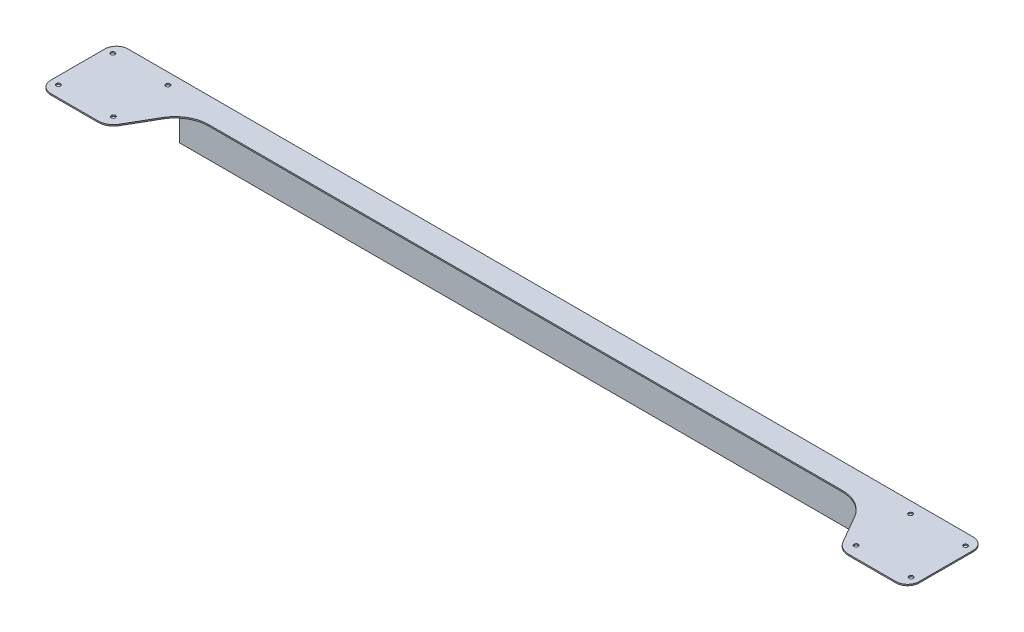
ISO-10303-21;
HEADER;
FILE_DESCRIPTION(('STEP AP214'),'2;1');
FILE_NAME('part.step','',(''),(''),'','','');
FILE_SCHEMA(('AUTOMOTIVE_DESIGN { 1 0 10303 214 1 1 1 1 }'));
ENDSEC;
DATA;
#1=APPLICATION_CONTEXT('core data for automotive mechanical design processes');
#2=APPLICATION_PROTOCOL_DEFINITION('international standard','automotive_design',2000,#1);
#3=PRODUCT_CONTEXT('',#1,'mechanical');
#4=PRODUCT('Part','Part','',(#3));
#5=PRODUCT_RELATED_PRODUCT_CATEGORY('part','',(#4));
#6=PRODUCT_DEFINITION_FORMATION('','',#4);
#7=PRODUCT_DEFINITION_CONTEXT('part definition',#1,'design');
#8=PRODUCT_DEFINITION('design','',#6,#7);
#9=PRODUCT_DEFINITION_SHAPE('','',#8);
#10=(LENGTH_UNIT() NAMED_UNIT(*) SI_UNIT(.MILLI.,.METRE.));
#11=(NAMED_UNIT(*) PLANE_ANGLE_UNIT() SI_UNIT($,.RADIAN.));
#12=(NAMED_UNIT(*) SI_UNIT($,.STERADIAN.) SOLID_ANGLE_UNIT());
#13=UNCERTAINTY_MEASURE_WITH_UNIT(LENGTH_MEASURE(1.E-05),#10,'distance_accuracy_value','');
#14=(GEOMETRIC_REPRESENTATION_CONTEXT(3) GLOBAL_UNCERTAINTY_ASSIGNED_CONTEXT((#13)) GLOBAL_UNIT_ASSIGNED_CONTEXT((#10,
#11,#12)) REPRESENTATION_CONTEXT('',''));
#15=CARTESIAN_POINT('',(0.,0.,0.));
#16=DIRECTION('',(0.,0.,1.));
#17=DIRECTION('',(1.,0.,0.));
#18=AXIS2_PLACEMENT_3D('',#15,#16,#17);
#19=CARTESIAN_POINT('',(4141.94054132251,12.7,4174.57954132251));
#20=DIRECTION('',(0.,1.,0.));
#21=DIRECTION('',(0.,0.,1.));
#22=AXIS2_PLACEMENT_3D('',#19,#20,#21);
#23=PLANE('',#22);
#24=CARTESIAN_POINT('',(4180.04054132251,12.7,4177.11954132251));
#25=DIRECTION('',(0.,1.,0.));
#26=DIRECTION('',(0.,0.,1.));
#27=AXIS2_PLACEMENT_3D('',#24,#25,#26);
#28=CIRCLE('',#27,20.6375000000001);
#29=CARTESIAN_POINT('',(4180.04054132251,12.7,4197.75704132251));
#30=VERTEX_POINT('',#29);
#31=EDGE_CURVE('E349',#30,#30,#28,.T.);
#32=ORIENTED_EDGE('',*,*,#31,.F.);
#33=EDGE_LOOP('',(#32));
#34=FACE_BOUND('',#33,.T.);
#35=CARTESIAN_POINT('',(3640.19612534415,12.7,3643.11712534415));
#36=DIRECTION('',(0.,1.,0.));
#37=DIRECTION('',(0.,0.,1.));
#38=AXIS2_PLACEMENT_3D('',#35,#36,#37);
#39=CIRCLE('',#38,20.6375000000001);
#40=CARTESIAN_POINT('',(3640.19612534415,12.7,3663.75462534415));
#41=VERTEX_POINT('',#40);
#42=EDGE_CURVE('E337',#41,#41,#39,.T.);
#43=ORIENTED_EDGE('',*,*,#42,.F.);
#44=EDGE_LOOP('',(#43));
#45=FACE_BOUND('',#44,.T.);
#46=CARTESIAN_POINT('',(-3640.19612534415,12.7,3643.11712534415));
#47=DIRECTION('',(0.,1.,0.));
#48=DIRECTION('',(0.,0.,1.));
#49=AXIS2_PLACEMENT_3D('',#46,#47,#48);
#50=CIRCLE('',#49,20.6375000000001);
#51=CARTESIAN_POINT('',(-3640.19612534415,12.7,3663.75462534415));
#52=VERTEX_POINT('',#51);
#53=EDGE_CURVE('E325',#52,#52,#50,.T.);
#54=ORIENTED_EDGE('',*,*,#53,.F.);
#55=EDGE_LOOP('',(#54));
#56=FACE_BOUND('',#55,.T.);
#57=CARTESIAN_POINT('',(-4180.04054132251,12.7,3643.11712534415));
#58=DIRECTION('',(0.,1.,0.));
#59=DIRECTION('',(0.,0.,1.));
#60=AXIS2_PLACEMENT_3D('',#57,#58,#59);
#61=CIRCLE('',#60,20.6375000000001);
#62=CARTESIAN_POINT('',(-4180.04054132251,12.7,3663.75462534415));
#63=VERTEX_POINT('',#62);
#64=EDGE_CURVE('E196',#63,#63,#61,.T.);
#65=ORIENTED_EDGE('',*,*,#64,.F.);
#66=EDGE_LOOP('',(#65));
#67=FACE_BOUND('',#66,.T.);
#68=CARTESIAN_POINT('',(4141.94054132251,12.7,4174.57954132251));
#69=DIRECTION('',(0.,1.,0.));
#70=DIRECTION('',(0.,0.,1.));
#71=AXIS2_PLACEMENT_3D('',#68,#69,#70);
#72=CIRCLE('',#71,114.3);
#73=CARTESIAN_POINT('',(4141.94054132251,12.7,4288.87954132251));
#74=VERTEX_POINT('',#73);
#75=CARTESIAN_POINT('',(4256.24054132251,12.7,4174.57954132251));
#76=VERTEX_POINT('',#75);
#77=EDGE_CURVE('E224',#74,#76,#72,.T.);
#78=ORIENTED_EDGE('',*,*,#77,.T.);
#79=DIRECTION('',(0.,0.,-1.));
#80=VECTOR('',#79,1.);
#81=CARTESIAN_POINT('',(4256.24054132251,12.7,3645.65712534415));
#82=LINE('',#81,#80);
#83=CARTESIAN_POINT('',(4256.24054132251,12.7,3645.65712534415));
#84=VERTEX_POINT('',#83);
#85=EDGE_CURVE('E124',#76,#84,#82,.T.);
#86=ORIENTED_EDGE('',*,*,#85,.T.);
#87=CARTESIAN_POINT('',(4141.94054132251,12.7,3645.65712534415));
#88=DIRECTION('',(0.,1.,0.));
#89=DIRECTION('',(0.,0.,-1.));
#90=AXIS2_PLACEMENT_3D('',#87,#88,#89);
#91=CIRCLE('',#90,114.3);
#92=CARTESIAN_POINT('',(4141.94054132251,12.7,3531.35712534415));
#93=VERTEX_POINT('',#92);
#94=EDGE_CURVE('E263',#84,#93,#91,.T.);
#95=ORIENTED_EDGE('',*,*,#94,.T.);
#96=DIRECTION('',(-1.,0.,0.));
#97=VECTOR('',#96,1.);
#98=CARTESIAN_POINT('',(-4141.94054132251,12.7,3531.35712534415));
#99=LINE('',#98,#97);
#100=CARTESIAN_POINT('',(-4141.94054132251,12.7,3531.35712534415));
#101=VERTEX_POINT('',#100);
#102=EDGE_CURVE('E282',#93,#101,#99,.T.);
#103=ORIENTED_EDGE('',*,*,#102,.T.);
#104=CARTESIAN_POINT('',(-4141.94054132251,12.7,3645.65712534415));
#105=DIRECTION('',(0.,1.,0.));
#106=DIRECTION('',(0.,0.,1.));
#107=AXIS2_PLACEMENT_3D('',#104,#105,#106);
#108=CIRCLE('',#107,114.3);
#109=CARTESIAN_POINT('',(-4256.24054132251,12.7,3645.65712534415));
#110=VERTEX_POINT('',#109);
#111=EDGE_CURVE('E279',#101,#110,#108,.T.);
#112=ORIENTED_EDGE('',*,*,#111,.T.);
#113=DIRECTION('',(0.,0.,1.));
#114=VECTOR('',#113,1.);
#115=CARTESIAN_POINT('',(-4256.24054132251,12.7,3645.65712534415));
#116=LINE('',#115,#114);
#117=CARTESIAN_POINT('',(-4256.24054132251,12.7,4174.57954132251));
#118=VERTEX_POINT('',#117);
#119=EDGE_CURVE('E281',#110,#118,#116,.T.);
#120=ORIENTED_EDGE('',*,*,#119,.T.);
#121=CARTESIAN_POINT('',(-4141.94054132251,12.7,4174.57954132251));
#122=DIRECTION('',(0.,1.,0.));
#123=DIRECTION('',(0.,0.,1.));
#124=AXIS2_PLACEMENT_3D('',#121,#122,#123);
#125=CIRCLE('',#124,114.300000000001);
#126=CARTESIAN_POINT('',(-4141.94054132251,12.7,4288.87954132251));
#127=VERTEX_POINT('',#126);
#128=EDGE_CURVE('E284',#118,#127,#125,.T.);
#129=ORIENTED_EDGE('',*,*,#128,.T.);
#130=DIRECTION('',(1.,0.,0.));
#131=VECTOR('',#130,1.);
#132=CARTESIAN_POINT('',(-4141.94054132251,12.7,4288.87954132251));
#133=LINE('',#132,#131);
#134=CARTESIAN_POINT('',(-3678.29610755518,12.7,4288.87954132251));
#135=VERTEX_POINT('',#134);
#136=EDGE_CURVE('E290',#127,#135,#133,.T.);
#137=ORIENTED_EDGE('',*,*,#136,.T.);
#138=CARTESIAN_POINT('',(-3678.29610755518,12.7,4136.47954132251));
#139=DIRECTION('',(0.,1.,0.));
#140=DIRECTION('',(0.,0.,1.));
#141=AXIS2_PLACEMENT_3D('',#138,#139,#140);
#142=CIRCLE('',#141,152.399999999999);
#143=CARTESIAN_POINT('',(-3546.31383601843,12.7,4212.67954132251));
#144=VERTEX_POINT('',#143);
#145=EDGE_CURVE('E292',#135,#144,#142,.T.);
#146=ORIENTED_EDGE('',*,*,#145,.T.);
#147=DIRECTION('',(0.5,0.,-0.866025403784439));
#148=VECTOR('',#147,1.);
#149=CARTESIAN_POINT('',(-3546.31383601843,12.7,4212.67954132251));
#150=LINE('',#149,#148);
#151=CARTESIAN_POINT('',(-3390.55352459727,12.7,3942.89476813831));
#152=VERTEX_POINT('',#151);
#153=EDGE_CURVE('E294',#144,#152,#150,.T.);
#154=ORIENTED_EDGE('',*,*,#153,.T.);
#155=CARTESIAN_POINT('',(-3104.59193626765,12.7,4107.99476813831));
#156=DIRECTION('',(0.,-1.,0.));
#157=DIRECTION('',(0.,0.,-1.));
#158=AXIS2_PLACEMENT_3D('',#155,#156,#157);
#159=CIRCLE('',#158,330.200000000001);
#160=CARTESIAN_POINT('',(-3104.59193626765,12.7,3777.79476813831));
#161=VERTEX_POINT('',#160);
#162=EDGE_CURVE('E296',#152,#161,#159,.T.);
#163=ORIENTED_EDGE('',*,*,#162,.T.);
#164=DIRECTION('',(1.,0.,0.));
#165=VECTOR('',#164,1.);
#166=CARTESIAN_POINT('',(-3104.59193626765,12.7,3777.79476813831));
#167=LINE('',#166,#165);
#168=CARTESIAN_POINT('',(3104.59195443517,12.7,3777.79476813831));
#169=VERTEX_POINT('',#168);
#170=EDGE_CURVE('E298',#161,#169,#167,.T.);
#171=ORIENTED_EDGE('',*,*,#170,.T.);
#172=CARTESIAN_POINT('',(3104.59195443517,12.7,4107.99476813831));
#173=DIRECTION('',(0.,-1.,0.));
#174=DIRECTION('',(0.,0.,-1.));
#175=AXIS2_PLACEMENT_3D('',#172,#173,#174);
#176=CIRCLE('',#175,330.200000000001);
#177=CARTESIAN_POINT('',(3390.55354276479,12.7,3942.89476813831));
#178=VERTEX_POINT('',#177);
#179=EDGE_CURVE('E171',#169,#178,#176,.T.);
#180=ORIENTED_EDGE('',*,*,#179,.T.);
#181=DIRECTION('',(0.500000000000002,0.,0.866025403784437));
#182=VECTOR('',#181,1.);
#183=CARTESIAN_POINT('',(3390.55354276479,12.7,3942.89476813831));
#184=LINE('',#183,#182);
#185=CARTESIAN_POINT('',(3546.31385418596,12.7,4212.67954132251));
#186=VERTEX_POINT('',#185);
#187=EDGE_CURVE('E164',#178,#186,#184,.T.);
#188=ORIENTED_EDGE('',*,*,#187,.T.);
#189=CARTESIAN_POINT('',(3678.29612572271,12.7,4136.47954132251));
#190=DIRECTION('',(0.,1.,0.));
#191=DIRECTION('',(0.,0.,-1.));
#192=AXIS2_PLACEMENT_3D('',#189,#190,#191);
#193=CIRCLE('',#192,152.399999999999);
#194=CARTESIAN_POINT('',(3678.29612572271,12.7,4288.87954132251));
#195=VERTEX_POINT('',#194);
#196=EDGE_CURVE('E168',#186,#195,#193,.T.);
#197=ORIENTED_EDGE('',*,*,#196,.T.);
#198=DIRECTION('',(1.,0.,0.));
#199=VECTOR('',#198,1.);
#200=CARTESIAN_POINT('',(3678.29612572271,12.7,4288.87954132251));
#201=LINE('',#200,#199);
#202=EDGE_CURVE('E59',#195,#74,#201,.T.);
#203=ORIENTED_EDGE('',*,*,#202,.T.);
#204=EDGE_LOOP('',(#78,#86,#95,#103,#112,#120,#129,#137,#146,#154,#163,#171,#180,#188,#197,#203));
#205=FACE_BOUND('',#204,.T.);
#206=CARTESIAN_POINT('',(-4180.04054132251,12.7,4177.11954132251));
#207=DIRECTION('',(0.,1.,0.));
#208=DIRECTION('',(0.,0.,1.));
#209=AXIS2_PLACEMENT_3D('',#206,#207,#208);
#210=CIRCLE('',#209,20.6375000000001);
#211=CARTESIAN_POINT('',(-4180.04054132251,12.7,4197.75704132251));
#212=VERTEX_POINT('',#211);
#213=EDGE_CURVE('E319',#212,#212,#210,.T.);
#214=ORIENTED_EDGE('',*,*,#213,.F.);
#215=EDGE_LOOP('',(#214));
#216=FACE_BOUND('',#215,.T.);
#217=CARTESIAN_POINT('',(-3640.19612534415,12.7,4177.11954132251));
#218=DIRECTION('',(0.,1.,0.));
#219=DIRECTION('',(0.,0.,1.));
#220=AXIS2_PLACEMENT_3D('',#217,#218,#219);
#221=CIRCLE('',#220,20.6375000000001);
#222=CARTESIAN_POINT('',(-3640.19612534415,12.7,4197.75704132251));
#223=VERTEX_POINT('',#222);
#224=EDGE_CURVE('E331',#223,#223,#221,.T.);
#225=ORIENTED_EDGE('',*,*,#224,.F.);
#226=EDGE_LOOP('',(#225));
#227=FACE_BOUND('',#226,.T.);
#228=CARTESIAN_POINT('',(4180.04054132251,12.7,3643.11712534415));
#229=DIRECTION('',(0.,1.,0.));
#230=DIRECTION('',(0.,0.,1.));
#231=AXIS2_PLACEMENT_3D('',#228,#229,#230);
#232=CIRCLE('',#231,20.6375000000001);
#233=CARTESIAN_POINT('',(4180.04054132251,12.7,3663.75462534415));
#234=VERTEX_POINT('',#233);
#235=EDGE_CURVE('E343',#234,#234,#232,.T.);
#236=ORIENTED_EDGE('',*,*,#235,.F.);
#237=EDGE_LOOP('',(#236));
#238=FACE_BOUND('',#237,.T.);
#239=CARTESIAN_POINT('',(3640.19612534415,12.7,4177.11954132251));
#240=DIRECTION('',(0.,1.,0.));
#241=DIRECTION('',(0.,0.,1.));
#242=AXIS2_PLACEMENT_3D('',#239,#240,#241);
#243=CIRCLE('',#242,20.6375000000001);
#244=CARTESIAN_POINT('',(3640.19612534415,12.7,4197.75704132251));
#245=VERTEX_POINT('',#244);
#246=EDGE_CURVE('E355',#245,#245,#243,.T.);
#247=ORIENTED_EDGE('',*,*,#246,.F.);
#248=EDGE_LOOP('',(#247));
#249=FACE_BOUND('',#248,.T.);
#250=ADVANCED_FACE('F35',(#34,#45,#56,#67,#205,#216,#227,#238,#249),#23,.T.);
#251=CARTESIAN_POINT('',(4141.94054132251,0.,4174.57954132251));
#252=DIRECTION('',(0.,1.,0.));
#253=DIRECTION('',(0.,0.,1.));
#254=AXIS2_PLACEMENT_3D('',#251,#252,#253);
#255=PLANE('',#254);
#256=DIRECTION('',(-1.,0.,0.));
#257=VECTOR('',#256,1.);
#258=CARTESIAN_POINT('',(-3513.19612534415,0.,3652.19469674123));
#259=LINE('',#258,#257);
#260=CARTESIAN_POINT('',(3513.19613425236,0.,3652.19469674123));
#261=VERTEX_POINT('',#260);
#262=CARTESIAN_POINT('',(-3513.19612534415,0.,3652.19469674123));
#263=VERTEX_POINT('',#262);
#264=EDGE_CURVE('E374',#261,#263,#259,.T.);
#265=ORIENTED_EDGE('',*,*,#264,.T.);
#266=DIRECTION('',(0.,0.,1.));
#267=VECTOR('',#266,1.);
#268=CARTESIAN_POINT('',(-3513.19612534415,0.,3652.19469674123));
#269=LINE('',#268,#267);
#270=CARTESIAN_POINT('',(-3513.19612534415,0.,3656.95719674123));
#271=VERTEX_POINT('',#270);
#272=EDGE_CURVE('E382',#263,#271,#269,.T.);
#273=ORIENTED_EDGE('',*,*,#272,.T.);
#274=DIRECTION('',(1.,0.,0.));
#275=VECTOR('',#274,1.);
#276=CARTESIAN_POINT('',(-3513.19612534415,0.,3656.95719674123));
#277=LINE('',#276,#275);
#278=CARTESIAN_POINT('',(3513.19613425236,0.,3656.95719674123));
#279=VERTEX_POINT('',#278);
#280=EDGE_CURVE('E379',#271,#279,#277,.T.);
#281=ORIENTED_EDGE('',*,*,#280,.T.);
#282=DIRECTION('',(0.,0.,-1.));
#283=VECTOR('',#282,1.);
#284=CARTESIAN_POINT('',(3513.19613425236,0.,3652.19469674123));
#285=LINE('',#284,#283);
#286=EDGE_CURVE('E50',#279,#261,#285,.T.);
#287=ORIENTED_EDGE('',*,*,#286,.T.);
#288=EDGE_LOOP('',(#265,#273,#281,#287));
#289=FACE_BOUND('',#288,.T.);
#290=CARTESIAN_POINT('',(4141.94054132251,0.,4174.57954132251));
#291=DIRECTION('',(0.,1.,0.));
#292=DIRECTION('',(0.,0.,1.));
#293=AXIS2_PLACEMENT_3D('',#290,#291,#292);
#294=CIRCLE('',#293,114.3);
#295=CARTESIAN_POINT('',(4141.94054132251,0.,4288.87954132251));
#296=VERTEX_POINT('',#295);
#297=CARTESIAN_POINT('',(4256.24054132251,0.,4174.57954132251));
#298=VERTEX_POINT('',#297);
#299=EDGE_CURVE('E192',#296,#298,#294,.T.);
#300=ORIENTED_EDGE('',*,*,#299,.F.);
#301=DIRECTION('',(1.,0.,0.));
#302=VECTOR('',#301,1.);
#303=CARTESIAN_POINT('',(3678.29612572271,0.,4288.87954132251));
#304=LINE('',#303,#302);
#305=CARTESIAN_POINT('',(3678.29612572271,0.,4288.87954132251));
#306=VERTEX_POINT('',#305);
#307=EDGE_CURVE('E116',#306,#296,#304,.T.);
#308=ORIENTED_EDGE('',*,*,#307,.F.);
#309=CARTESIAN_POINT('',(3678.29612572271,0.,4136.47954132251));
#310=DIRECTION('',(0.,1.,0.));
#311=DIRECTION('',(0.,0.,-1.));
#312=AXIS2_PLACEMENT_3D('',#309,#310,#311);
#313=CIRCLE('',#312,152.399999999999);
#314=CARTESIAN_POINT('',(3546.31385418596,0.,4212.67954132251));
#315=VERTEX_POINT('',#314);
#316=EDGE_CURVE('E221',#315,#306,#313,.T.);
#317=ORIENTED_EDGE('',*,*,#316,.F.);
#318=DIRECTION('',(0.500000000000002,0.,0.866025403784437));
#319=VECTOR('',#318,1.);
#320=CARTESIAN_POINT('',(3390.55354276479,0.,3942.89476813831));
#321=LINE('',#320,#319);
#322=CARTESIAN_POINT('',(3390.55354276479,0.,3942.89476813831));
#323=VERTEX_POINT('',#322);
#324=EDGE_CURVE('E180',#323,#315,#321,.T.);
#325=ORIENTED_EDGE('',*,*,#324,.F.);
#326=CARTESIAN_POINT('',(3104.59195443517,0.,4107.99476813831));
#327=DIRECTION('',(0.,-1.,0.));
#328=DIRECTION('',(0.,0.,-1.));
#329=AXIS2_PLACEMENT_3D('',#326,#327,#328);
#330=CIRCLE('',#329,330.200000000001);
#331=CARTESIAN_POINT('',(3104.59195443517,0.,3777.79476813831));
#332=VERTEX_POINT('',#331);
#333=EDGE_CURVE('E218',#332,#323,#330,.T.);
#334=ORIENTED_EDGE('',*,*,#333,.F.);
#335=DIRECTION('',(1.,0.,0.));
#336=VECTOR('',#335,1.);
#337=CARTESIAN_POINT('',(-3104.59193626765,0.,3777.79476813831));
#338=LINE('',#337,#336);
#339=CARTESIAN_POINT('',(-3104.59193626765,0.,3777.79476813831));
#340=VERTEX_POINT('',#339);
#341=EDGE_CURVE('E216',#340,#332,#338,.T.);
#342=ORIENTED_EDGE('',*,*,#341,.F.);
#343=CARTESIAN_POINT('',(-3104.59193626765,0.,4107.99476813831));
#344=DIRECTION('',(0.,-1.,0.));
#345=DIRECTION('',(0.,0.,-1.));
#346=AXIS2_PLACEMENT_3D('',#343,#344,#345);
#347=CIRCLE('',#346,330.200000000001);
#348=CARTESIAN_POINT('',(-3390.55352459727,0.,3942.89476813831));
#349=VERTEX_POINT('',#348);
#350=EDGE_CURVE('E214',#349,#340,#347,.T.);
#351=ORIENTED_EDGE('',*,*,#350,.F.);
#352=DIRECTION('',(0.5,0.,-0.866025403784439));
#353=VECTOR('',#352,1.);
#354=CARTESIAN_POINT('',(-3546.31383601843,0.,4212.67954132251));
#355=LINE('',#354,#353);
#356=CARTESIAN_POINT('',(-3546.31383601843,0.,4212.67954132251));
#357=VERTEX_POINT('',#356);
#358=EDGE_CURVE('E212',#357,#349,#355,.T.);
#359=ORIENTED_EDGE('',*,*,#358,.F.);
#360=CARTESIAN_POINT('',(-3678.29610755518,0.,4136.47954132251));
#361=DIRECTION('',(0.,1.,0.));
#362=DIRECTION('',(0.,0.,1.));
#363=AXIS2_PLACEMENT_3D('',#360,#361,#362);
#364=CIRCLE('',#363,152.399999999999);
#365=CARTESIAN_POINT('',(-3678.29610755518,0.,4288.87954132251));
#366=VERTEX_POINT('',#365);
#367=EDGE_CURVE('E210',#366,#357,#364,.T.);
#368=ORIENTED_EDGE('',*,*,#367,.F.);
#369=DIRECTION('',(1.,0.,0.));
#370=VECTOR('',#369,1.);
#371=CARTESIAN_POINT('',(-4141.94054132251,0.,4288.87954132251));
#372=LINE('',#371,#370);
#373=CARTESIAN_POINT('',(-4141.94054132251,0.,4288.87954132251));
#374=VERTEX_POINT('',#373);
#375=EDGE_CURVE('E208',#374,#366,#372,.T.);
#376=ORIENTED_EDGE('',*,*,#375,.F.);
#377=CARTESIAN_POINT('',(-4141.94054132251,0.,4174.57954132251));
#378=DIRECTION('',(0.,1.,0.));
#379=DIRECTION('',(0.,0.,1.));
#380=AXIS2_PLACEMENT_3D('',#377,#378,#379);
#381=CIRCLE('',#380,114.300000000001);
#382=CARTESIAN_POINT('',(-4256.24054132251,0.,4174.57954132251));
#383=VERTEX_POINT('',#382);
#384=EDGE_CURVE('E206',#383,#374,#381,.T.);
#385=ORIENTED_EDGE('',*,*,#384,.F.);
#386=DIRECTION('',(0.,0.,1.));
#387=VECTOR('',#386,1.);
#388=CARTESIAN_POINT('',(-4256.24054132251,0.,3645.65712534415));
#389=LINE('',#388,#387);
#390=CARTESIAN_POINT('',(-4256.24054132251,0.,3645.65712534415));
#391=VERTEX_POINT('',#390);
#392=EDGE_CURVE('E204',#391,#383,#389,.T.);
#393=ORIENTED_EDGE('',*,*,#392,.F.);
#394=CARTESIAN_POINT('',(-4141.94054132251,0.,3645.65712534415));
#395=DIRECTION('',(0.,1.,0.));
#396=DIRECTION('',(0.,0.,1.));
#397=AXIS2_PLACEMENT_3D('',#394,#395,#396);
#398=CIRCLE('',#397,114.3);
#399=CARTESIAN_POINT('',(-4141.94054132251,0.,3531.35712534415));
#400=VERTEX_POINT('',#399);
#401=EDGE_CURVE('E202',#400,#391,#398,.T.);
#402=ORIENTED_EDGE('',*,*,#401,.F.);
#403=DIRECTION('',(-1.,0.,0.));
#404=VECTOR('',#403,1.);
#405=CARTESIAN_POINT('',(-4141.94054132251,0.,3531.35712534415));
#406=LINE('',#405,#404);
#407=CARTESIAN_POINT('',(4141.94054132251,0.,3531.35712534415));
#408=VERTEX_POINT('',#407);
#409=EDGE_CURVE('E200',#408,#400,#406,.T.);
#410=ORIENTED_EDGE('',*,*,#409,.F.);
#411=CARTESIAN_POINT('',(4141.94054132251,0.,3645.65712534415));
#412=DIRECTION('',(0.,1.,0.));
#413=DIRECTION('',(0.,0.,-1.));
#414=AXIS2_PLACEMENT_3D('',#411,#412,#413);
#415=CIRCLE('',#414,114.3);
#416=CARTESIAN_POINT('',(4256.24054132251,0.,3645.65712534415));
#417=VERTEX_POINT('',#416);
#418=EDGE_CURVE('E198',#417,#408,#415,.T.);
#419=ORIENTED_EDGE('',*,*,#418,.F.);
#420=DIRECTION('',(0.,0.,-1.));
#421=VECTOR('',#420,1.);
#422=CARTESIAN_POINT('',(4256.24054132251,0.,3645.65712534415));
#423=LINE('',#422,#421);
#424=EDGE_CURVE('E195',#298,#417,#423,.T.);
#425=ORIENTED_EDGE('',*,*,#424,.F.);
#426=EDGE_LOOP('',(#300,#308,#317,#325,#334,#342,#351,#359,#368,#376,#385,#393,#402,#410,#419,#425));
#427=FACE_BOUND('',#426,.T.);
#428=CARTESIAN_POINT('',(-4180.04054132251,0.,3643.11712534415));
#429=DIRECTION('',(0.,1.,0.));
#430=DIRECTION('',(0.,0.,1.));
#431=AXIS2_PLACEMENT_3D('',#428,#429,#430);
#432=CIRCLE('',#431,20.6375000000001);
#433=CARTESIAN_POINT('',(-4180.04054132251,0.,3663.75462534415));
#434=VERTEX_POINT('',#433);
#435=EDGE_CURVE('E316',#434,#434,#432,.T.);
#436=ORIENTED_EDGE('',*,*,#435,.T.);
#437=EDGE_LOOP('',(#436));
#438=FACE_BOUND('',#437,.T.);
#439=CARTESIAN_POINT('',(-4180.04054132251,0.,4177.11954132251));
#440=DIRECTION('',(0.,1.,0.));
#441=DIRECTION('',(0.,0.,1.));
#442=AXIS2_PLACEMENT_3D('',#439,#440,#441);
#443=CIRCLE('',#442,20.6375000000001);
#444=CARTESIAN_POINT('',(-4180.04054132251,0.,4197.75704132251));
#445=VERTEX_POINT('',#444);
#446=EDGE_CURVE('E322',#445,#445,#443,.T.);
#447=ORIENTED_EDGE('',*,*,#446,.T.);
#448=EDGE_LOOP('',(#447));
#449=FACE_BOUND('',#448,.T.);
#450=CARTESIAN_POINT('',(-3640.19612534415,0.,3643.11712534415));
#451=DIRECTION('',(0.,1.,0.));
#452=DIRECTION('',(0.,0.,1.));
#453=AXIS2_PLACEMENT_3D('',#450,#451,#452);
#454=CIRCLE('',#453,20.6375000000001);
#455=CARTESIAN_POINT('',(-3640.19612534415,0.,3663.75462534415));
#456=VERTEX_POINT('',#455);
#457=EDGE_CURVE('E328',#456,#456,#454,.T.);
#458=ORIENTED_EDGE('',*,*,#457,.T.);
#459=EDGE_LOOP('',(#458));
#460=FACE_BOUND('',#459,.T.);
#461=CARTESIAN_POINT('',(-3640.19612534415,0.,4177.11954132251));
#462=DIRECTION('',(0.,1.,0.));
#463=DIRECTION('',(0.,0.,1.));
#464=AXIS2_PLACEMENT_3D('',#461,#462,#463);
#465=CIRCLE('',#464,20.6375000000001);
#466=CARTESIAN_POINT('',(-3640.19612534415,0.,4197.75704132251));
#467=VERTEX_POINT('',#466);
#468=EDGE_CURVE('E334',#467,#467,#465,.T.);
#469=ORIENTED_EDGE('',*,*,#468,.T.);
#470=EDGE_LOOP('',(#469));
#471=FACE_BOUND('',#470,.T.);
#472=CARTESIAN_POINT('',(3640.19612534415,0.,3643.11712534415));
#473=DIRECTION('',(0.,1.,0.));
#474=DIRECTION('',(0.,0.,1.));
#475=AXIS2_PLACEMENT_3D('',#472,#473,#474);
#476=CIRCLE('',#475,20.6375000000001);
#477=CARTESIAN_POINT('',(3640.19612534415,0.,3663.75462534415));
#478=VERTEX_POINT('',#477);
#479=EDGE_CURVE('E340',#478,#478,#476,.T.);
#480=ORIENTED_EDGE('',*,*,#479,.T.);
#481=EDGE_LOOP('',(#480));
#482=FACE_BOUND('',#481,.T.);
#483=CARTESIAN_POINT('',(4180.04054132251,0.,3643.11712534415));
#484=DIRECTION('',(0.,1.,0.));
#485=DIRECTION('',(0.,0.,1.));
#486=AXIS2_PLACEMENT_3D('',#483,#484,#485);
#487=CIRCLE('',#486,20.6375000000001);
#488=CARTESIAN_POINT('',(4180.04054132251,0.,3663.75462534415));
#489=VERTEX_POINT('',#488);
#490=EDGE_CURVE('E346',#489,#489,#487,.T.);
#491=ORIENTED_EDGE('',*,*,#490,.T.);
#492=EDGE_LOOP('',(#491));
#493=FACE_BOUND('',#492,.T.);
#494=CARTESIAN_POINT('',(4180.04054132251,0.,4177.11954132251));
#495=DIRECTION('',(0.,1.,0.));
#496=DIRECTION('',(0.,0.,1.));
#497=AXIS2_PLACEMENT_3D('',#494,#495,#496);
#498=CIRCLE('',#497,20.6375000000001);
#499=CARTESIAN_POINT('',(4180.04054132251,0.,4197.75704132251));
#500=VERTEX_POINT('',#499);
#501=EDGE_CURVE('E352',#500,#500,#498,.T.);
#502=ORIENTED_EDGE('',*,*,#501,.T.);
#503=EDGE_LOOP('',(#502));
#504=FACE_BOUND('',#503,.T.);
#505=CARTESIAN_POINT('',(3640.19612534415,0.,4177.11954132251));
#506=DIRECTION('',(0.,1.,0.));
#507=DIRECTION('',(0.,0.,1.));
#508=AXIS2_PLACEMENT_3D('',#505,#506,#507);
#509=CIRCLE('',#508,20.6375000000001);
#510=CARTESIAN_POINT('',(3640.19612534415,0.,4197.75704132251));
#511=VERTEX_POINT('',#510);
#512=EDGE_CURVE('E358',#511,#511,#509,.T.);
#513=ORIENTED_EDGE('',*,*,#512,.T.);
#514=EDGE_LOOP('',(#513));
#515=FACE_BOUND('',#514,.T.);
#516=ADVANCED_FACE('F267',(#289,#427,#438,#449,#460,#471,#482,#493,#504,#515),#255,.F.);
#517=CARTESIAN_POINT('',(4141.94054132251,12.7,4174.57954132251));
#518=DIRECTION('',(0.,-1.,0.));
#519=DIRECTION('',(0.,0.,-1.));
#520=AXIS2_PLACEMENT_3D('',#517,#518,#519);
#521=CYLINDRICAL_SURFACE('',#520,114.3);
#522=ORIENTED_EDGE('',*,*,#299,.T.);
#523=DIRECTION('',(0.,-1.,0.));
#524=VECTOR('',#523,1.);
#525=CARTESIAN_POINT('',(4256.24054132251,12.7,4174.57954132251));
#526=LINE('',#525,#524);
#527=EDGE_CURVE('E11',#76,#298,#526,.T.);
#528=ORIENTED_EDGE('',*,*,#527,.F.);
#529=ORIENTED_EDGE('',*,*,#77,.F.);
#530=DIRECTION('',(0.,-1.,0.));
#531=VECTOR('',#530,1.);
#532=CARTESIAN_POINT('',(4141.94054132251,12.7,4288.87954132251));
#533=LINE('',#532,#531);
#534=EDGE_CURVE('E188',#74,#296,#533,.T.);
#535=ORIENTED_EDGE('',*,*,#534,.T.);
#536=EDGE_LOOP('',(#522,#528,#529,#535));
#537=FACE_BOUND('',#536,.T.);
#538=ADVANCED_FACE('F37',(#537),#521,.T.);
#539=CARTESIAN_POINT('',(4256.24054132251,12.7,3645.65712534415));
#540=DIRECTION('',(-1.,0.,0.));
#541=DIRECTION('',(0.,0.,1.));
#542=AXIS2_PLACEMENT_3D('',#539,#540,#541);
#543=PLANE('',#542);
#544=ORIENTED_EDGE('',*,*,#424,.T.);
#545=DIRECTION('',(0.,-1.,0.));
#546=VECTOR('',#545,1.);
#547=CARTESIAN_POINT('',(4256.24054132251,12.7,3645.65712534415));
#548=LINE('',#547,#546);
#549=EDGE_CURVE('E43',#84,#417,#548,.T.);
#550=ORIENTED_EDGE('',*,*,#549,.F.);
#551=ORIENTED_EDGE('',*,*,#85,.F.);
#552=ORIENTED_EDGE('',*,*,#527,.T.);
#553=EDGE_LOOP('',(#544,#550,#551,#552));
#554=FACE_BOUND('',#553,.T.);
#555=ADVANCED_FACE('F430',(#554),#543,.F.);
#556=CARTESIAN_POINT('',(4141.94054132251,12.7,3645.65712534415));
#557=DIRECTION('',(0.,-1.,0.));
#558=DIRECTION('',(0.,0.,-1.));
#559=AXIS2_PLACEMENT_3D('',#556,#557,#558);
#560=CYLINDRICAL_SURFACE('',#559,114.3);
#561=ORIENTED_EDGE('',*,*,#418,.T.);
#562=DIRECTION('',(0.,-1.,0.));
#563=VECTOR('',#562,1.);
#564=CARTESIAN_POINT('',(4141.94054132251,12.7,3531.35712534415));
#565=LINE('',#564,#563);
#566=EDGE_CURVE('E255',#93,#408,#565,.T.);
#567=ORIENTED_EDGE('',*,*,#566,.F.);
#568=ORIENTED_EDGE('',*,*,#94,.F.);
#569=ORIENTED_EDGE('',*,*,#549,.T.);
#570=EDGE_LOOP('',(#561,#567,#568,#569));
#571=FACE_BOUND('',#570,.T.);
#572=ADVANCED_FACE('F261',(#571),#560,.T.);
#573=CARTESIAN_POINT('',(-4141.94054132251,12.7,3531.35712534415));
#574=DIRECTION('',(0.,0.,1.));
#575=DIRECTION('',(1.,0.,0.));
#576=AXIS2_PLACEMENT_3D('',#573,#574,#575);
#577=PLANE('',#576);
#578=ORIENTED_EDGE('',*,*,#409,.T.);
#579=DIRECTION('',(0.,-1.,0.));
#580=VECTOR('',#579,1.);
#581=CARTESIAN_POINT('',(-4141.94054132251,12.7,3531.35712534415));
#582=LINE('',#581,#580);
#583=EDGE_CURVE('E252',#101,#400,#582,.T.);
#584=ORIENTED_EDGE('',*,*,#583,.F.);
#585=ORIENTED_EDGE('',*,*,#102,.F.);
#586=ORIENTED_EDGE('',*,*,#566,.T.);
#587=EDGE_LOOP('',(#578,#584,#585,#586));
#588=FACE_BOUND('',#587,.T.);
#589=ADVANCED_FACE('F273',(#588),#577,.F.);
#590=CARTESIAN_POINT('',(-4141.94054132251,12.7,3645.65712534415));
#591=DIRECTION('',(0.,-1.,0.));
#592=DIRECTION('',(0.,0.,-1.));
#593=AXIS2_PLACEMENT_3D('',#590,#591,#592);
#594=CYLINDRICAL_SURFACE('',#593,114.3);
#595=ORIENTED_EDGE('',*,*,#401,.T.);
#596=DIRECTION('',(0.,-1.,0.));
#597=VECTOR('',#596,1.);
#598=CARTESIAN_POINT('',(-4256.24054132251,12.7,3645.65712534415));
#599=LINE('',#598,#597);
#600=EDGE_CURVE('E249',#110,#391,#599,.T.);
#601=ORIENTED_EDGE('',*,*,#600,.F.);
#602=ORIENTED_EDGE('',*,*,#111,.F.);
#603=ORIENTED_EDGE('',*,*,#583,.T.);
#604=EDGE_LOOP('',(#595,#601,#602,#603));
#605=FACE_BOUND('',#604,.T.);
#606=ADVANCED_FACE('F277',(#605),#594,.T.);
#607=CARTESIAN_POINT('',(-4256.24054132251,12.7,3645.65712534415));
#608=DIRECTION('',(1.,0.,0.));
#609=DIRECTION('',(0.,0.,-1.));
#610=AXIS2_PLACEMENT_3D('',#607,#608,#609);
#611=PLANE('',#610);
#612=ORIENTED_EDGE('',*,*,#392,.T.);
#613=DIRECTION('',(0.,-1.,0.));
#614=VECTOR('',#613,1.);
#615=CARTESIAN_POINT('',(-4256.24054132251,12.7,4174.57954132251));
#616=LINE('',#615,#614);
#617=EDGE_CURVE('E246',#118,#383,#616,.T.);
#618=ORIENTED_EDGE('',*,*,#617,.F.);
#619=ORIENTED_EDGE('',*,*,#119,.F.);
#620=ORIENTED_EDGE('',*,*,#600,.T.);
#621=EDGE_LOOP('',(#612,#618,#619,#620));
#622=FACE_BOUND('',#621,.T.);
#623=ADVANCED_FACE('F465',(#622),#611,.F.);
#624=CARTESIAN_POINT('',(-4141.94054132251,12.7,4174.57954132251));
#625=DIRECTION('',(0.,-1.,0.));
#626=DIRECTION('',(0.,0.,-1.));
#627=AXIS2_PLACEMENT_3D('',#624,#625,#626);
#628=CYLINDRICAL_SURFACE('',#627,114.300000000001);
#629=ORIENTED_EDGE('',*,*,#384,.T.);
#630=DIRECTION('',(0.,-1.,0.));
#631=VECTOR('',#630,1.);
#632=CARTESIAN_POINT('',(-4141.94054132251,12.7,4288.87954132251));
#633=LINE('',#632,#631);
#634=EDGE_CURVE('E243',#127,#374,#633,.T.);
#635=ORIENTED_EDGE('',*,*,#634,.F.);
#636=ORIENTED_EDGE('',*,*,#128,.F.);
#637=ORIENTED_EDGE('',*,*,#617,.T.);
#638=EDGE_LOOP('',(#629,#635,#636,#637));
#639=FACE_BOUND('',#638,.T.);
#640=ADVANCED_FACE('F461',(#639),#628,.T.);
#641=CARTESIAN_POINT('',(-4141.94054132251,12.7,4288.87954132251));
#642=DIRECTION('',(0.,0.,-1.));
#643=DIRECTION('',(-1.,0.,0.));
#644=AXIS2_PLACEMENT_3D('',#641,#642,#643);
#645=PLANE('',#644);
#646=ORIENTED_EDGE('',*,*,#375,.T.);
#647=DIRECTION('',(0.,-1.,0.));
#648=VECTOR('',#647,1.);
#649=CARTESIAN_POINT('',(-3678.29610755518,12.7,4288.87954132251));
#650=LINE('',#649,#648);
#651=EDGE_CURVE('E240',#135,#366,#650,.T.);
#652=ORIENTED_EDGE('',*,*,#651,.F.);
#653=ORIENTED_EDGE('',*,*,#136,.F.);
#654=ORIENTED_EDGE('',*,*,#634,.T.);
#655=EDGE_LOOP('',(#646,#652,#653,#654));
#656=FACE_BOUND('',#655,.T.);
#657=ADVANCED_FACE('F457',(#656),#645,.F.);
#658=CARTESIAN_POINT('',(-3678.29610755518,12.7,4136.47954132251));
#659=DIRECTION('',(0.,-1.,0.));
#660=DIRECTION('',(0.,0.,-1.));
#661=AXIS2_PLACEMENT_3D('',#658,#659,#660);
#662=CYLINDRICAL_SURFACE('',#661,152.399999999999);
#663=ORIENTED_EDGE('',*,*,#367,.T.);
#664=DIRECTION('',(0.,-1.,0.));
#665=VECTOR('',#664,1.);
#666=CARTESIAN_POINT('',(-3546.31383601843,12.7,4212.67954132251));
#667=LINE('',#666,#665);
#668=EDGE_CURVE('E237',#144,#357,#667,.T.);
#669=ORIENTED_EDGE('',*,*,#668,.F.);
#670=ORIENTED_EDGE('',*,*,#145,.F.);
#671=ORIENTED_EDGE('',*,*,#651,.T.);
#672=EDGE_LOOP('',(#663,#669,#670,#671));
#673=FACE_BOUND('',#672,.T.);
#674=ADVANCED_FACE('F453',(#673),#662,.T.);
#675=CARTESIAN_POINT('',(-3546.31383601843,12.7,4212.67954132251));
#676=DIRECTION('',(-0.866025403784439,0.,-0.499999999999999));
#677=DIRECTION('',(-0.5,0.,0.866025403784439));
#678=AXIS2_PLACEMENT_3D('',#675,#676,#677);
#679=PLANE('',#678);
#680=ORIENTED_EDGE('',*,*,#358,.T.);
#681=DIRECTION('',(0.,-1.,0.));
#682=VECTOR('',#681,1.);
#683=CARTESIAN_POINT('',(-3390.55352459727,12.7,3942.89476813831));
#684=LINE('',#683,#682);
#685=EDGE_CURVE('E234',#152,#349,#684,.T.);
#686=ORIENTED_EDGE('',*,*,#685,.F.);
#687=ORIENTED_EDGE('',*,*,#153,.F.);
#688=ORIENTED_EDGE('',*,*,#668,.T.);
#689=EDGE_LOOP('',(#680,#686,#687,#688));
#690=FACE_BOUND('',#689,.T.);
#691=ADVANCED_FACE('F449',(#690),#679,.F.);
#692=CARTESIAN_POINT('',(-3104.59193626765,12.7,4107.99476813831));
#693=DIRECTION('',(0.,-1.,0.));
#694=DIRECTION('',(0.,0.,-1.));
#695=AXIS2_PLACEMENT_3D('',#692,#693,#694);
#696=CYLINDRICAL_SURFACE('',#695,330.200000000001);
#697=ORIENTED_EDGE('',*,*,#350,.T.);
#698=DIRECTION('',(0.,-1.,0.));
#699=VECTOR('',#698,1.);
#700=CARTESIAN_POINT('',(-3104.59193626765,12.7,3777.79476813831));
#701=LINE('',#700,#699);
#702=EDGE_CURVE('E231',#161,#340,#701,.T.);
#703=ORIENTED_EDGE('',*,*,#702,.F.);
#704=ORIENTED_EDGE('',*,*,#162,.F.);
#705=ORIENTED_EDGE('',*,*,#685,.T.);
#706=EDGE_LOOP('',(#697,#703,#704,#705));
#707=FACE_BOUND('',#706,.T.);
#708=ADVANCED_FACE('F446',(#707),#696,.F.);
#709=CARTESIAN_POINT('',(-3104.59193626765,12.7,3777.79476813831));
#710=DIRECTION('',(0.,0.,-1.));
#711=DIRECTION('',(-1.,0.,0.));
#712=AXIS2_PLACEMENT_3D('',#709,#710,#711);
#713=PLANE('',#712);
#714=ORIENTED_EDGE('',*,*,#341,.T.);
#715=DIRECTION('',(0.,-1.,0.));
#716=VECTOR('',#715,1.);
#717=CARTESIAN_POINT('',(3104.59195443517,12.7,3777.79476813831));
#718=LINE('',#717,#716);
#719=EDGE_CURVE('E228',#169,#332,#718,.T.);
#720=ORIENTED_EDGE('',*,*,#719,.F.);
#721=ORIENTED_EDGE('',*,*,#170,.F.);
#722=ORIENTED_EDGE('',*,*,#702,.T.);
#723=EDGE_LOOP('',(#714,#720,#721,#722));
#724=FACE_BOUND('',#723,.T.);
#725=ADVANCED_FACE('F304',(#724),#713,.F.);
#726=CARTESIAN_POINT('',(3104.59195443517,12.7,4107.99476813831));
#727=DIRECTION('',(0.,-1.,0.));
#728=DIRECTION('',(0.,0.,-1.));
#729=AXIS2_PLACEMENT_3D('',#726,#727,#728);
#730=CYLINDRICAL_SURFACE('',#729,330.200000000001);
#731=ORIENTED_EDGE('',*,*,#333,.T.);
#732=DIRECTION('',(0.,-1.,0.));
#733=VECTOR('',#732,1.);
#734=CARTESIAN_POINT('',(3390.55354276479,12.7,3942.89476813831));
#735=LINE('',#734,#733);
#736=EDGE_CURVE('E183',#178,#323,#735,.T.);
#737=ORIENTED_EDGE('',*,*,#736,.F.);
#738=ORIENTED_EDGE('',*,*,#179,.F.);
#739=ORIENTED_EDGE('',*,*,#719,.T.);
#740=EDGE_LOOP('',(#731,#737,#738,#739));
#741=FACE_BOUND('',#740,.T.);
#742=ADVANCED_FACE('F308',(#741),#730,.F.);
#743=CARTESIAN_POINT('',(3390.55354276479,12.7,3942.89476813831));
#744=DIRECTION('',(0.866025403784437,0.,-0.500000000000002));
#745=DIRECTION('',(-0.500000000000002,0.,-0.866025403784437));
#746=AXIS2_PLACEMENT_3D('',#743,#744,#745);
#747=PLANE('',#746);
#748=ORIENTED_EDGE('',*,*,#324,.T.);
#749=DIRECTION('',(0.,-1.,0.));
#750=VECTOR('',#749,1.);
#751=CARTESIAN_POINT('',(3546.31385418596,12.7,4212.67954132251));
#752=LINE('',#751,#750);
#753=EDGE_CURVE('E177',#186,#315,#752,.T.);
#754=ORIENTED_EDGE('',*,*,#753,.F.);
#755=ORIENTED_EDGE('',*,*,#187,.F.);
#756=ORIENTED_EDGE('',*,*,#736,.T.);
#757=EDGE_LOOP('',(#748,#754,#755,#756));
#758=FACE_BOUND('',#757,.T.);
#759=ADVANCED_FACE('F178',(#758),#747,.F.);
#760=CARTESIAN_POINT('',(3678.29612572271,12.7,4136.47954132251));
#761=DIRECTION('',(0.,-1.,0.));
#762=DIRECTION('',(0.,0.,-1.));
#763=AXIS2_PLACEMENT_3D('',#760,#761,#762);
#764=CYLINDRICAL_SURFACE('',#763,152.399999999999);
#765=ORIENTED_EDGE('',*,*,#316,.T.);
#766=DIRECTION('',(0.,-1.,0.));
#767=VECTOR('',#766,1.);
#768=CARTESIAN_POINT('',(3678.29612572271,12.7,4288.87954132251));
#769=LINE('',#768,#767);
#770=EDGE_CURVE('E184',#195,#306,#769,.T.);
#771=ORIENTED_EDGE('',*,*,#770,.F.);
#772=ORIENTED_EDGE('',*,*,#196,.F.);
#773=ORIENTED_EDGE('',*,*,#753,.T.);
#774=EDGE_LOOP('',(#765,#771,#772,#773));
#775=FACE_BOUND('',#774,.T.);
#776=ADVANCED_FACE('F186',(#775),#764,.T.);
#777=CARTESIAN_POINT('',(3678.29612572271,12.7,4288.87954132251));
#778=DIRECTION('',(0.,0.,-1.));
#779=DIRECTION('',(-1.,0.,0.));
#780=AXIS2_PLACEMENT_3D('',#777,#778,#779);
#781=PLANE('',#780);
#782=ORIENTED_EDGE('',*,*,#307,.T.);
#783=ORIENTED_EDGE('',*,*,#534,.F.);
#784=ORIENTED_EDGE('',*,*,#202,.F.);
#785=ORIENTED_EDGE('',*,*,#770,.T.);
#786=EDGE_LOOP('',(#782,#783,#784,#785));
#787=FACE_BOUND('',#786,.T.);
#788=ADVANCED_FACE('F309',(#787),#781,.F.);
#789=CARTESIAN_POINT('',(-4180.04054132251,12.7,3643.11712534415));
#790=DIRECTION('',(0.,-1.,0.));
#791=DIRECTION('',(0.,0.,-1.));
#792=AXIS2_PLACEMENT_3D('',#789,#790,#791);
#793=CYLINDRICAL_SURFACE('',#792,20.6375000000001);
#794=ORIENTED_EDGE('',*,*,#64,.T.);
#795=EDGE_LOOP('',(#794));
#796=FACE_BOUND('',#795,.T.);
#797=ORIENTED_EDGE('',*,*,#435,.F.);
#798=EDGE_LOOP('',(#797));
#799=FACE_BOUND('',#798,.T.);
#800=ADVANCED_FACE('F437',(#796,#799),#793,.F.);
#801=CARTESIAN_POINT('',(-4180.04054132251,12.7,4177.11954132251));
#802=DIRECTION('',(0.,-1.,0.));
#803=DIRECTION('',(0.,0.,-1.));
#804=AXIS2_PLACEMENT_3D('',#801,#802,#803);
#805=CYLINDRICAL_SURFACE('',#804,20.6375000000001);
#806=ORIENTED_EDGE('',*,*,#213,.T.);
#807=EDGE_LOOP('',(#806));
#808=FACE_BOUND('',#807,.T.);
#809=ORIENTED_EDGE('',*,*,#446,.F.);
#810=EDGE_LOOP('',(#809));
#811=FACE_BOUND('',#810,.T.);
#812=ADVANCED_FACE('F542',(#808,#811),#805,.F.);
#813=CARTESIAN_POINT('',(-3640.19612534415,12.7,3643.11712534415));
#814=DIRECTION('',(0.,-1.,0.));
#815=DIRECTION('',(0.,0.,-1.));
#816=AXIS2_PLACEMENT_3D('',#813,#814,#815);
#817=CYLINDRICAL_SURFACE('',#816,20.6375000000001);
#818=ORIENTED_EDGE('',*,*,#53,.T.);
#819=EDGE_LOOP('',(#818));
#820=FACE_BOUND('',#819,.T.);
#821=ORIENTED_EDGE('',*,*,#457,.F.);
#822=EDGE_LOOP('',(#821));
#823=FACE_BOUND('',#822,.T.);
#824=ADVANCED_FACE('F549',(#820,#823),#817,.F.);
#825=CARTESIAN_POINT('',(-3640.19612534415,12.7,4177.11954132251));
#826=DIRECTION('',(0.,-1.,0.));
#827=DIRECTION('',(0.,0.,-1.));
#828=AXIS2_PLACEMENT_3D('',#825,#826,#827);
#829=CYLINDRICAL_SURFACE('',#828,20.6375000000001);
#830=ORIENTED_EDGE('',*,*,#224,.T.);
#831=EDGE_LOOP('',(#830));
#832=FACE_BOUND('',#831,.T.);
#833=ORIENTED_EDGE('',*,*,#468,.F.);
#834=EDGE_LOOP('',(#833));
#835=FACE_BOUND('',#834,.T.);
#836=ADVANCED_FACE('F557',(#832,#835),#829,.F.);
#837=CARTESIAN_POINT('',(3640.19612534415,12.7,3643.11712534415));
#838=DIRECTION('',(0.,-1.,0.));
#839=DIRECTION('',(0.,0.,-1.));
#840=AXIS2_PLACEMENT_3D('',#837,#838,#839);
#841=CYLINDRICAL_SURFACE('',#840,20.6375000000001);
#842=ORIENTED_EDGE('',*,*,#42,.T.);
#843=EDGE_LOOP('',(#842));
#844=FACE_BOUND('',#843,.T.);
#845=ORIENTED_EDGE('',*,*,#479,.F.);
#846=EDGE_LOOP('',(#845));
#847=FACE_BOUND('',#846,.T.);
#848=ADVANCED_FACE('F565',(#844,#847),#841,.F.);
#849=CARTESIAN_POINT('',(4180.04054132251,12.7,3643.11712534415));
#850=DIRECTION('',(0.,-1.,0.));
#851=DIRECTION('',(0.,0.,-1.));
#852=AXIS2_PLACEMENT_3D('',#849,#850,#851);
#853=CYLINDRICAL_SURFACE('',#852,20.6375000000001);
#854=ORIENTED_EDGE('',*,*,#235,.T.);
#855=EDGE_LOOP('',(#854));
#856=FACE_BOUND('',#855,.T.);
#857=ORIENTED_EDGE('',*,*,#490,.F.);
#858=EDGE_LOOP('',(#857));
#859=FACE_BOUND('',#858,.T.);
#860=ADVANCED_FACE('F573',(#856,#859),#853,.F.);
#861=CARTESIAN_POINT('',(4180.04054132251,12.7,4177.11954132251));
#862=DIRECTION('',(0.,-1.,0.));
#863=DIRECTION('',(0.,0.,-1.));
#864=AXIS2_PLACEMENT_3D('',#861,#862,#863);
#865=CYLINDRICAL_SURFACE('',#864,20.6375000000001);
#866=ORIENTED_EDGE('',*,*,#31,.T.);
#867=EDGE_LOOP('',(#866));
#868=FACE_BOUND('',#867,.T.);
#869=ORIENTED_EDGE('',*,*,#501,.F.);
#870=EDGE_LOOP('',(#869));
#871=FACE_BOUND('',#870,.T.);
#872=ADVANCED_FACE('F581',(#868,#871),#865,.F.);
#873=CARTESIAN_POINT('',(3640.19612534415,12.7,4177.11954132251));
#874=DIRECTION('',(0.,-1.,0.));
#875=DIRECTION('',(0.,0.,-1.));
#876=AXIS2_PLACEMENT_3D('',#873,#874,#875);
#877=CYLINDRICAL_SURFACE('',#876,20.6375000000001);
#878=ORIENTED_EDGE('',*,*,#246,.T.);
#879=EDGE_LOOP('',(#878));
#880=FACE_BOUND('',#879,.T.);
#881=ORIENTED_EDGE('',*,*,#512,.F.);
#882=EDGE_LOOP('',(#881));
#883=FACE_BOUND('',#882,.T.);
#884=ADVANCED_FACE('F589',(#880,#883),#877,.F.);
#885=CARTESIAN_POINT('',(-3513.19612534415,-406.4,3652.19469674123));
#886=DIRECTION('',(-1.,0.,0.));
#887=DIRECTION('',(0.,0.,1.));
#888=AXIS2_PLACEMENT_3D('',#885,#886,#887);
#889=PLANE('',#888);
#890=ORIENTED_EDGE('',*,*,#272,.F.);
#891=DIRECTION('',(0.,1.,0.));
#892=VECTOR('',#891,1.);
#893=CARTESIAN_POINT('',(-3513.19612534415,-406.4,3652.19469674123));
#894=LINE('',#893,#892);
#895=CARTESIAN_POINT('',(-3513.19612534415,-406.4,3652.19469674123));
#896=VERTEX_POINT('',#895);
#897=EDGE_CURVE('E361',#896,#263,#894,.T.);
#898=ORIENTED_EDGE('',*,*,#897,.F.);
#899=DIRECTION('',(0.,0.,1.));
#900=VECTOR('',#899,1.);
#901=CARTESIAN_POINT('',(-3513.19612534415,-406.4,3652.19469674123));
#902=LINE('',#901,#900);
#903=CARTESIAN_POINT('',(-3513.19612534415,-406.4,3656.95719674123));
#904=VERTEX_POINT('',#903);
#905=EDGE_CURVE('E377',#896,#904,#902,.T.);
#906=ORIENTED_EDGE('',*,*,#905,.T.);
#907=DIRECTION('',(0.,1.,0.));
#908=VECTOR('',#907,1.);
#909=CARTESIAN_POINT('',(-3513.19612534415,-406.4,3656.95719674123));
#910=LINE('',#909,#908);
#911=EDGE_CURVE('E364',#904,#271,#910,.T.);
#912=ORIENTED_EDGE('',*,*,#911,.T.);
#913=EDGE_LOOP('',(#890,#898,#906,#912));
#914=FACE_BOUND('',#913,.T.);
#915=ADVANCED_FACE('F399',(#914),#889,.T.);
#916=CARTESIAN_POINT('',(-3513.19612534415,-406.4,3652.19469674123));
#917=DIRECTION('',(0.,0.,-1.));
#918=DIRECTION('',(-1.,0.,0.));
#919=AXIS2_PLACEMENT_3D('',#916,#917,#918);
#920=PLANE('',#919);
#921=ORIENTED_EDGE('',*,*,#264,.F.);
#922=DIRECTION('',(0.,1.,0.));
#923=VECTOR('',#922,1.);
#924=CARTESIAN_POINT('',(3513.19613425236,-406.4,3652.19469674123));
#925=LINE('',#924,#923);
#926=CARTESIAN_POINT('',(3513.19613425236,-406.4,3652.19469674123));
#927=VERTEX_POINT('',#926);
#928=EDGE_CURVE('E370',#927,#261,#925,.T.);
#929=ORIENTED_EDGE('',*,*,#928,.F.);
#930=DIRECTION('',(-1.,0.,0.));
#931=VECTOR('',#930,1.);
#932=CARTESIAN_POINT('',(-3513.19612534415,-406.4,3652.19469674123));
#933=LINE('',#932,#931);
#934=EDGE_CURVE('E368',#927,#896,#933,.T.);
#935=ORIENTED_EDGE('',*,*,#934,.T.);
#936=ORIENTED_EDGE('',*,*,#897,.T.);
#937=EDGE_LOOP('',(#921,#929,#935,#936));
#938=FACE_BOUND('',#937,.T.);
#939=ADVANCED_FACE('F415',(#938),#920,.T.);
#940=CARTESIAN_POINT('',(3513.19613425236,-406.4,3652.19469674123));
#941=DIRECTION('',(1.,0.,0.));
#942=DIRECTION('',(0.,0.,-1.));
#943=AXIS2_PLACEMENT_3D('',#940,#941,#942);
#944=PLANE('',#943);
#945=ORIENTED_EDGE('',*,*,#286,.F.);
#946=DIRECTION('',(0.,1.,0.));
#947=VECTOR('',#946,1.);
#948=CARTESIAN_POINT('',(3513.19613425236,-406.4,3656.95719674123));
#949=LINE('',#948,#947);
#950=CARTESIAN_POINT('',(3513.19613425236,-406.4,3656.95719674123));
#951=VERTEX_POINT('',#950);
#952=EDGE_CURVE('E367',#951,#279,#949,.T.);
#953=ORIENTED_EDGE('',*,*,#952,.F.);
#954=DIRECTION('',(0.,0.,-1.));
#955=VECTOR('',#954,1.);
#956=CARTESIAN_POINT('',(3513.19613425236,-406.4,3652.19469674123));
#957=LINE('',#956,#955);
#958=EDGE_CURVE('E387',#951,#927,#957,.T.);
#959=ORIENTED_EDGE('',*,*,#958,.T.);
#960=ORIENTED_EDGE('',*,*,#928,.T.);
#961=EDGE_LOOP('',(#945,#953,#959,#960));
#962=FACE_BOUND('',#961,.T.);
#963=ADVANCED_FACE('F418',(#962),#944,.T.);
#964=CARTESIAN_POINT('',(-3513.19612534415,-406.4,3656.95719674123));
#965=DIRECTION('',(0.,0.,1.));
#966=DIRECTION('',(1.,0.,0.));
#967=AXIS2_PLACEMENT_3D('',#964,#965,#966);
#968=PLANE('',#967);
#969=ORIENTED_EDGE('',*,*,#280,.F.);
#970=ORIENTED_EDGE('',*,*,#911,.F.);
#971=DIRECTION('',(1.,0.,0.));
#972=VECTOR('',#971,1.);
#973=CARTESIAN_POINT('',(-3513.19612534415,-406.4,3656.95719674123));
#974=LINE('',#973,#972);
#975=EDGE_CURVE('E390',#904,#951,#974,.T.);
#976=ORIENTED_EDGE('',*,*,#975,.T.);
#977=ORIENTED_EDGE('',*,*,#952,.T.);
#978=EDGE_LOOP('',(#969,#970,#976,#977));
#979=FACE_BOUND('',#978,.T.);
#980=ADVANCED_FACE('F421',(#979),#968,.T.);
#981=CARTESIAN_POINT('',(0.,-406.4,0.));
#982=DIRECTION('',(0.,1.,0.));
#983=DIRECTION('',(0.,0.,1.));
#984=AXIS2_PLACEMENT_3D('',#981,#982,#983);
#985=PLANE('',#984);
#986=ORIENTED_EDGE('',*,*,#905,.F.);
#987=ORIENTED_EDGE('',*,*,#934,.F.);
#988=ORIENTED_EDGE('',*,*,#958,.F.);
#989=ORIENTED_EDGE('',*,*,#975,.F.);
#990=EDGE_LOOP('',(#986,#987,#988,#989));
#991=FACE_BOUND('',#990,.T.);
#992=ADVANCED_FACE('F408',(#991),#985,.F.);
#993=CLOSED_SHELL('',(#250,#516,#538,#555,#572,#589,#606,#623,#640,#657,#674,#691,#708,#725,
#742,#759,#776,#788,#800,#812,#824,#836,#848,#860,#872,#884,#915,#939,#963,#980,#992));
#994=MANIFOLD_SOLID_BREP('B2',#993);
#995=ADVANCED_BREP_SHAPE_REPRESENTATION('',(#18,#994),#14);
#996=SHAPE_DEFINITION_REPRESENTATION(#9,#995);
ENDSEC;
END-ISO-10303-21;
